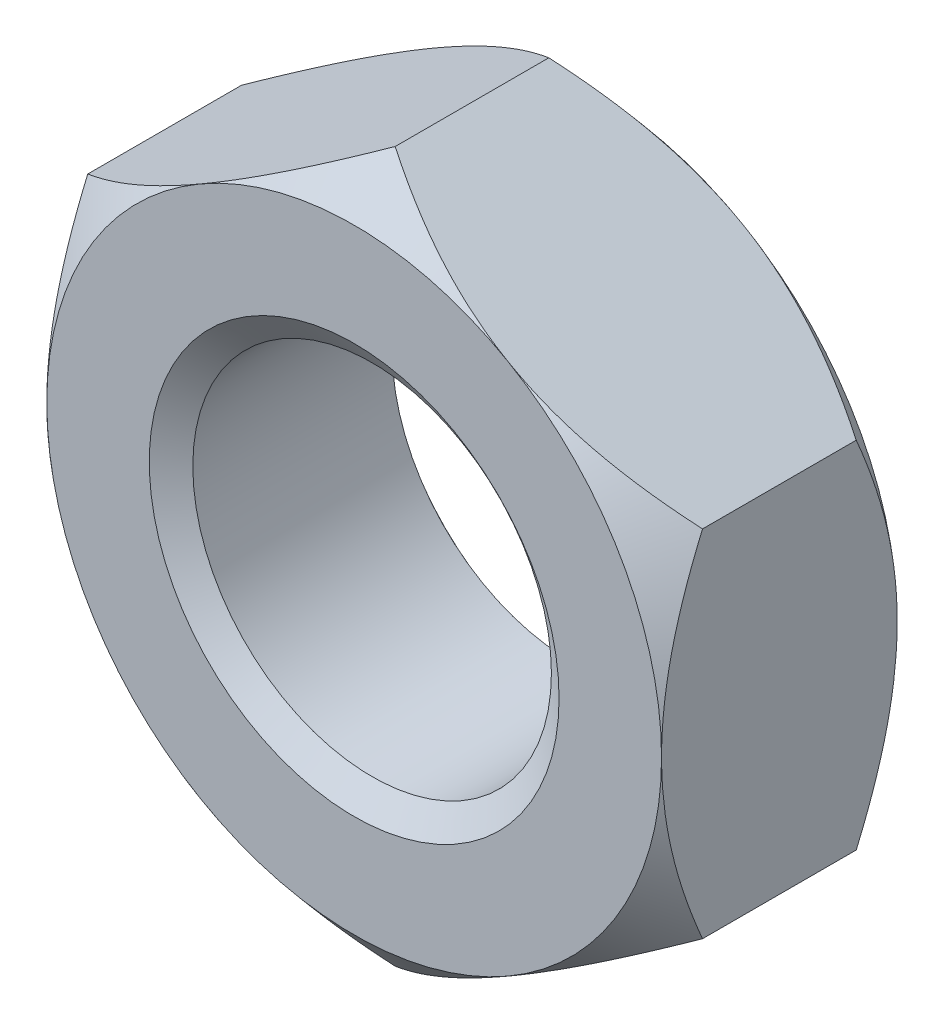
from build123d import *

# Parameters (mm, degrees)
BASENUTSKE_R  = 11.1125
BASENUT_DEPTH = 14.605


with BuildPart() as part:
    # BaseNutSke → BaseNut (new body)
    with BuildSketch(Plane.XY):
        Polygon((19.05, 10.998522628), (19.05, -10.998522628), (0, -21.997045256), (-19.05, -10.998522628), (-19.05, 10.998522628), (0, 21.997045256), align=None)
        Circle(BASENUTSKE_R, mode=Mode.SUBTRACT)
    extrude(amount=-BASENUT_DEPTH)

    # Sketch3 → Double-Chamfer (revolve, cut)
    with BuildSketch(Plane(origin=(0, 0, 0), x_dir=(0, 0, -1), z_dir=(1, 0, 0))):
        Polygon((14.605, 19.05), (12.065, 21.997045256), (12.065, 34.697045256), (27.305, 34.697045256), (27.305, 19.05), align=None)
        Polygon((2.54, 34.697045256), (-12.7, 34.697045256), (-12.7, 19.05), (0, 19.05), (2.54, 21.997045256), align=None)
    revolve(axis=Axis((0, 0, 0), (0, 0, -1)), mode=Mode.SUBTRACT)

    # EndChamferSke → EndChamfer (revolve, cut)
    with BuildSketch(Plane(origin=(0, 0, 0), x_dir=(0, 0, -1), z_dir=(1, 0, 0)), mode=Mode.PRIVATE) as endchamfer_sk:
        Polygon((14.5796, 12.7), (13.356862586, 10.95375), (14.6304, 10.95375), (14.6304, 12.7), align=None)
        Polygon((-0.0508, 12.7), (0, 12.7), (1.222737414, 10.95375), (-0.0508, 10.95375), align=None)
    revolve(endchamfer_sk.sketch.rotate(Axis((0, 0, -25.037505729), (0, 0, -1)), 90), axis=Axis((0, 0, -25.037505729), (0, 0, -1)), mode=Mode.SUBTRACT)


solid = part.part
